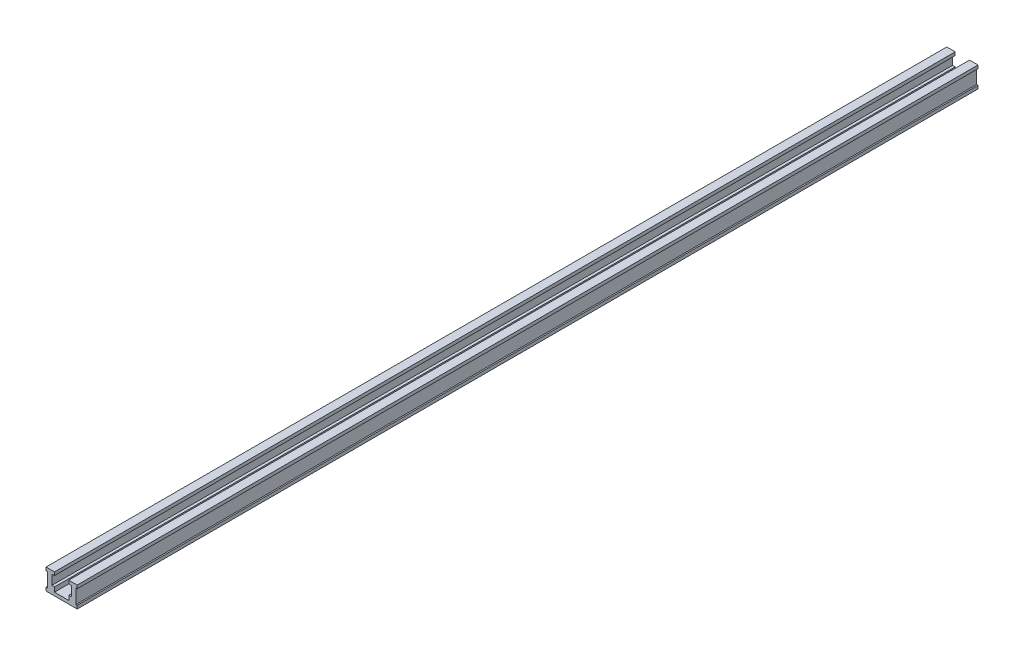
ISO-10303-21;
HEADER;
FILE_DESCRIPTION(('STEP AP214'),'2;1');
FILE_NAME('part.step','',(''),(''),'','','');
FILE_SCHEMA(('AUTOMOTIVE_DESIGN { 1 0 10303 214 1 1 1 1 }'));
ENDSEC;
DATA;
#1=APPLICATION_CONTEXT('core data for automotive mechanical design processes');
#2=APPLICATION_PROTOCOL_DEFINITION('international standard','automotive_design',2000,#1);
#3=PRODUCT_CONTEXT('',#1,'mechanical');
#4=PRODUCT('Part','Part','',(#3));
#5=PRODUCT_RELATED_PRODUCT_CATEGORY('part','',(#4));
#6=PRODUCT_DEFINITION_FORMATION('','',#4);
#7=PRODUCT_DEFINITION_CONTEXT('part definition',#1,'design');
#8=PRODUCT_DEFINITION('design','',#6,#7);
#9=PRODUCT_DEFINITION_SHAPE('','',#8);
#10=(LENGTH_UNIT() NAMED_UNIT(*) SI_UNIT(.MILLI.,.METRE.));
#11=(NAMED_UNIT(*) PLANE_ANGLE_UNIT() SI_UNIT($,.RADIAN.));
#12=(NAMED_UNIT(*) SI_UNIT($,.STERADIAN.) SOLID_ANGLE_UNIT());
#13=UNCERTAINTY_MEASURE_WITH_UNIT(LENGTH_MEASURE(1.E-05),#10,'distance_accuracy_value','');
#14=(GEOMETRIC_REPRESENTATION_CONTEXT(3) GLOBAL_UNCERTAINTY_ASSIGNED_CONTEXT((#13)) GLOBAL_UNIT_ASSIGNED_CONTEXT((#10,
#11,#12)) REPRESENTATION_CONTEXT('',''));
#15=CARTESIAN_POINT('',(0.,0.,0.));
#16=DIRECTION('',(0.,0.,1.));
#17=DIRECTION('',(1.,0.,0.));
#18=AXIS2_PLACEMENT_3D('',#15,#16,#17);
#19=CARTESIAN_POINT('',(2.90949351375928,-9.45107636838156,550.));
#20=DIRECTION('',(0.,-1.,0.));
#21=DIRECTION('',(0.,0.,-1.));
#22=AXIS2_PLACEMENT_3D('',#19,#20,#21);
#23=PLANE('',#22);
#24=DIRECTION('',(-1.,0.,0.));
#25=VECTOR('',#24,1.);
#26=CARTESIAN_POINT('',(2.90949351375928,-9.45107636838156,0.));
#27=LINE('',#26,#25);
#28=CARTESIAN_POINT('',(3.70324351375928,-9.45107636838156,0.));
#29=VERTEX_POINT('',#28);
#30=CARTESIAN_POINT('',(2.90949351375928,-9.45107636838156,0.));
#31=VERTEX_POINT('',#30);
#32=EDGE_CURVE('E224',#29,#31,#27,.T.);
#33=ORIENTED_EDGE('',*,*,#32,.T.);
#34=DIRECTION('',(0.,0.,-1.));
#35=VECTOR('',#34,1.);
#36=CARTESIAN_POINT('',(2.90949351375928,-9.45107636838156,550.));
#37=LINE('',#36,#35);
#38=CARTESIAN_POINT('',(2.90949351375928,-9.45107636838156,550.));
#39=VERTEX_POINT('',#38);
#40=EDGE_CURVE('E11',#39,#31,#37,.T.);
#41=ORIENTED_EDGE('',*,*,#40,.F.);
#42=DIRECTION('',(-1.,0.,0.));
#43=VECTOR('',#42,1.);
#44=CARTESIAN_POINT('',(2.90949351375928,-9.45107636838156,550.));
#45=LINE('',#44,#43);
#46=CARTESIAN_POINT('',(3.70324351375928,-9.45107636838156,550.));
#47=VERTEX_POINT('',#46);
#48=EDGE_CURVE('E270',#47,#39,#45,.T.);
#49=ORIENTED_EDGE('',*,*,#48,.F.);
#50=DIRECTION('',(0.,0.,-1.));
#51=VECTOR('',#50,1.);
#52=CARTESIAN_POINT('',(3.70324351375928,-9.45107636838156,550.));
#53=LINE('',#52,#51);
#54=EDGE_CURVE('E220',#47,#29,#53,.T.);
#55=ORIENTED_EDGE('',*,*,#54,.T.);
#56=EDGE_LOOP('',(#33,#41,#49,#55));
#57=FACE_BOUND('',#56,.T.);
#58=ADVANCED_FACE('F32',(#57),#23,.F.);
#59=CARTESIAN_POINT('',(2.90949351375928,-0.719826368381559,550.));
#60=DIRECTION('',(-1.,0.,0.));
#61=DIRECTION('',(0.,0.,1.));
#62=AXIS2_PLACEMENT_3D('',#59,#60,#61);
#63=PLANE('',#62);
#64=DIRECTION('',(0.,1.,0.));
#65=VECTOR('',#64,1.);
#66=CARTESIAN_POINT('',(2.90949351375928,-0.719826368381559,0.));
#67=LINE('',#66,#65);
#68=CARTESIAN_POINT('',(2.90949351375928,-0.719826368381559,0.));
#69=VERTEX_POINT('',#68);
#70=EDGE_CURVE('E227',#31,#69,#67,.T.);
#71=ORIENTED_EDGE('',*,*,#70,.T.);
#72=DIRECTION('',(0.,0.,-1.));
#73=VECTOR('',#72,1.);
#74=CARTESIAN_POINT('',(2.90949351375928,-0.719826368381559,550.));
#75=LINE('',#74,#73);
#76=CARTESIAN_POINT('',(2.90949351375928,-0.719826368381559,550.));
#77=VERTEX_POINT('',#76);
#78=EDGE_CURVE('E40',#77,#69,#75,.T.);
#79=ORIENTED_EDGE('',*,*,#78,.F.);
#80=DIRECTION('',(0.,1.,0.));
#81=VECTOR('',#80,1.);
#82=CARTESIAN_POINT('',(2.90949351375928,-0.719826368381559,550.));
#83=LINE('',#82,#81);
#84=EDGE_CURVE('E139',#39,#77,#83,.T.);
#85=ORIENTED_EDGE('',*,*,#84,.F.);
#86=ORIENTED_EDGE('',*,*,#40,.T.);
#87=EDGE_LOOP('',(#71,#79,#85,#86));
#88=FACE_BOUND('',#87,.T.);
#89=ADVANCED_FACE('F408',(#88),#63,.F.);
#90=CARTESIAN_POINT('',(3.70324351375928,-0.719826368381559,550.));
#91=DIRECTION('',(0.,1.,0.));
#92=DIRECTION('',(0.,0.,1.));
#93=AXIS2_PLACEMENT_3D('',#90,#91,#92);
#94=PLANE('',#93);
#95=DIRECTION('',(1.,0.,0.));
#96=VECTOR('',#95,1.);
#97=CARTESIAN_POINT('',(3.70324351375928,-0.719826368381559,0.));
#98=LINE('',#97,#96);
#99=CARTESIAN_POINT('',(3.70324351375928,-0.719826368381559,0.));
#100=VERTEX_POINT('',#99);
#101=EDGE_CURVE('E229',#69,#100,#98,.T.);
#102=ORIENTED_EDGE('',*,*,#101,.T.);
#103=DIRECTION('',(0.,0.,-1.));
#104=VECTOR('',#103,1.);
#105=CARTESIAN_POINT('',(3.70324351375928,-0.719826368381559,550.));
#106=LINE('',#105,#104);
#107=CARTESIAN_POINT('',(3.70324351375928,-0.719826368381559,550.));
#108=VERTEX_POINT('',#107);
#109=EDGE_CURVE('E325',#108,#100,#106,.T.);
#110=ORIENTED_EDGE('',*,*,#109,.F.);
#111=DIRECTION('',(1.,0.,0.));
#112=VECTOR('',#111,1.);
#113=CARTESIAN_POINT('',(3.70324351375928,-0.719826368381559,550.));
#114=LINE('',#113,#112);
#115=EDGE_CURVE('E333',#77,#108,#114,.T.);
#116=ORIENTED_EDGE('',*,*,#115,.F.);
#117=ORIENTED_EDGE('',*,*,#78,.T.);
#118=EDGE_LOOP('',(#102,#110,#116,#117));
#119=FACE_BOUND('',#118,.T.);
#120=ADVANCED_FACE('F331',(#119),#94,.F.);
#121=CARTESIAN_POINT('',(3.70324351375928,1.26454863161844,550.));
#122=DIRECTION('',(-1.,0.,0.));
#123=DIRECTION('',(0.,0.,1.));
#124=AXIS2_PLACEMENT_3D('',#121,#122,#123);
#125=PLANE('',#124);
#126=DIRECTION('',(0.,1.,0.));
#127=VECTOR('',#126,1.);
#128=CARTESIAN_POINT('',(3.70324351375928,1.26454863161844,0.));
#129=LINE('',#128,#127);
#130=CARTESIAN_POINT('',(3.70324351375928,1.26454863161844,0.));
#131=VERTEX_POINT('',#130);
#132=EDGE_CURVE('E231',#100,#131,#129,.T.);
#133=ORIENTED_EDGE('',*,*,#132,.T.);
#134=DIRECTION('',(0.,0.,-1.));
#135=VECTOR('',#134,1.);
#136=CARTESIAN_POINT('',(3.70324351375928,1.26454863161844,550.));
#137=LINE('',#136,#135);
#138=CARTESIAN_POINT('',(3.70324351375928,1.26454863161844,550.));
#139=VERTEX_POINT('',#138);
#140=EDGE_CURVE('E322',#139,#131,#137,.T.);
#141=ORIENTED_EDGE('',*,*,#140,.F.);
#142=DIRECTION('',(0.,1.,0.));
#143=VECTOR('',#142,1.);
#144=CARTESIAN_POINT('',(3.70324351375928,1.26454863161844,550.));
#145=LINE('',#144,#143);
#146=EDGE_CURVE('E351',#108,#139,#145,.T.);
#147=ORIENTED_EDGE('',*,*,#146,.F.);
#148=ORIENTED_EDGE('',*,*,#109,.T.);
#149=EDGE_LOOP('',(#133,#141,#147,#148));
#150=FACE_BOUND('',#149,.T.);
#151=ADVANCED_FACE('F342',(#150),#125,.F.);
#152=CARTESIAN_POINT('',(-1.45613148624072,1.26454863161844,550.));
#153=DIRECTION('',(0.,-1.,0.));
#154=DIRECTION('',(0.,0.,-1.));
#155=AXIS2_PLACEMENT_3D('',#152,#153,#154);
#156=PLANE('',#155);
#157=DIRECTION('',(-1.,0.,0.));
#158=VECTOR('',#157,1.);
#159=CARTESIAN_POINT('',(-1.45613148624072,1.26454863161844,0.));
#160=LINE('',#159,#158);
#161=CARTESIAN_POINT('',(-1.45613148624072,1.26454863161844,0.));
#162=VERTEX_POINT('',#161);
#163=EDGE_CURVE('E233',#131,#162,#160,.T.);
#164=ORIENTED_EDGE('',*,*,#163,.T.);
#165=DIRECTION('',(0.,0.,-1.));
#166=VECTOR('',#165,1.);
#167=CARTESIAN_POINT('',(-1.45613148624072,1.26454863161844,550.));
#168=LINE('',#167,#166);
#169=CARTESIAN_POINT('',(-1.45613148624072,1.26454863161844,550.));
#170=VERTEX_POINT('',#169);
#171=EDGE_CURVE('E319',#170,#162,#168,.T.);
#172=ORIENTED_EDGE('',*,*,#171,.F.);
#173=DIRECTION('',(-1.,0.,0.));
#174=VECTOR('',#173,1.);
#175=CARTESIAN_POINT('',(-1.45613148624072,1.26454863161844,550.));
#176=LINE('',#175,#174);
#177=EDGE_CURVE('E348',#139,#170,#176,.T.);
#178=ORIENTED_EDGE('',*,*,#177,.F.);
#179=ORIENTED_EDGE('',*,*,#140,.T.);
#180=EDGE_LOOP('',(#164,#172,#178,#179));
#181=FACE_BOUND('',#180,.T.);
#182=ADVANCED_FACE('F346',(#181),#156,.F.);
#183=CARTESIAN_POINT('',(-1.45613148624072,-0.719826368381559,550.));
#184=DIRECTION('',(1.,0.,0.));
#185=DIRECTION('',(0.,0.,-1.));
#186=AXIS2_PLACEMENT_3D('',#183,#184,#185);
#187=PLANE('',#186);
#188=DIRECTION('',(0.,-1.,0.));
#189=VECTOR('',#188,1.);
#190=CARTESIAN_POINT('',(-1.45613148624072,-0.719826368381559,0.));
#191=LINE('',#190,#189);
#192=CARTESIAN_POINT('',(-1.45613148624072,-0.719826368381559,0.));
#193=VERTEX_POINT('',#192);
#194=EDGE_CURVE('E235',#162,#193,#191,.T.);
#195=ORIENTED_EDGE('',*,*,#194,.T.);
#196=DIRECTION('',(0.,0.,-1.));
#197=VECTOR('',#196,1.);
#198=CARTESIAN_POINT('',(-1.45613148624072,-0.719826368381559,550.));
#199=LINE('',#198,#197);
#200=CARTESIAN_POINT('',(-1.45613148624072,-0.719826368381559,550.));
#201=VERTEX_POINT('',#200);
#202=EDGE_CURVE('E316',#201,#193,#199,.T.);
#203=ORIENTED_EDGE('',*,*,#202,.F.);
#204=DIRECTION('',(0.,-1.,0.));
#205=VECTOR('',#204,1.);
#206=CARTESIAN_POINT('',(-1.45613148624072,-0.719826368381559,550.));
#207=LINE('',#206,#205);
#208=EDGE_CURVE('E350',#170,#201,#207,.T.);
#209=ORIENTED_EDGE('',*,*,#208,.F.);
#210=ORIENTED_EDGE('',*,*,#171,.T.);
#211=EDGE_LOOP('',(#195,#203,#209,#210));
#212=FACE_BOUND('',#211,.T.);
#213=ADVANCED_FACE('F421',(#212),#187,.F.);
#214=CARTESIAN_POINT('',(0.131368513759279,-0.719826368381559,550.));
#215=DIRECTION('',(0.,1.,0.));
#216=DIRECTION('',(0.,0.,1.));
#217=AXIS2_PLACEMENT_3D('',#214,#215,#216);
#218=PLANE('',#217);
#219=DIRECTION('',(1.,0.,0.));
#220=VECTOR('',#219,1.);
#221=CARTESIAN_POINT('',(0.131368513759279,-0.719826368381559,0.));
#222=LINE('',#221,#220);
#223=CARTESIAN_POINT('',(0.131368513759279,-0.719826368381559,0.));
#224=VERTEX_POINT('',#223);
#225=EDGE_CURVE('E237',#193,#224,#222,.T.);
#226=ORIENTED_EDGE('',*,*,#225,.T.);
#227=DIRECTION('',(0.,0.,-1.));
#228=VECTOR('',#227,1.);
#229=CARTESIAN_POINT('',(0.131368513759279,-0.719826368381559,550.));
#230=LINE('',#229,#228);
#231=CARTESIAN_POINT('',(0.131368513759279,-0.719826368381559,550.));
#232=VERTEX_POINT('',#231);
#233=EDGE_CURVE('E313',#232,#224,#230,.T.);
#234=ORIENTED_EDGE('',*,*,#233,.F.);
#235=DIRECTION('',(1.,0.,0.));
#236=VECTOR('',#235,1.);
#237=CARTESIAN_POINT('',(0.131368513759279,-0.719826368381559,550.));
#238=LINE('',#237,#236);
#239=EDGE_CURVE('E353',#201,#232,#238,.T.);
#240=ORIENTED_EDGE('',*,*,#239,.F.);
#241=ORIENTED_EDGE('',*,*,#202,.T.);
#242=EDGE_LOOP('',(#226,#234,#240,#241));
#243=FACE_BOUND('',#242,.T.);
#244=ADVANCED_FACE('F424',(#243),#218,.F.);
#245=CARTESIAN_POINT('',(0.131368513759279,-6.67295136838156,550.));
#246=DIRECTION('',(1.,0.,0.));
#247=DIRECTION('',(0.,0.,-1.));
#248=AXIS2_PLACEMENT_3D('',#245,#246,#247);
#249=PLANE('',#248);
#250=DIRECTION('',(0.,-1.,0.));
#251=VECTOR('',#250,1.);
#252=CARTESIAN_POINT('',(0.131368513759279,-6.67295136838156,0.));
#253=LINE('',#252,#251);
#254=CARTESIAN_POINT('',(0.131368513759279,-6.67295136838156,0.));
#255=VERTEX_POINT('',#254);
#256=EDGE_CURVE('E239',#224,#255,#253,.T.);
#257=ORIENTED_EDGE('',*,*,#256,.T.);
#258=DIRECTION('',(0.,0.,-1.));
#259=VECTOR('',#258,1.);
#260=CARTESIAN_POINT('',(0.131368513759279,-6.67295136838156,550.));
#261=LINE('',#260,#259);
#262=CARTESIAN_POINT('',(0.131368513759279,-6.67295136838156,550.));
#263=VERTEX_POINT('',#262);
#264=EDGE_CURVE('E310',#263,#255,#261,.T.);
#265=ORIENTED_EDGE('',*,*,#264,.F.);
#266=DIRECTION('',(0.,-1.,0.));
#267=VECTOR('',#266,1.);
#268=CARTESIAN_POINT('',(0.131368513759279,-6.67295136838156,550.));
#269=LINE('',#268,#267);
#270=EDGE_CURVE('E359',#232,#263,#269,.T.);
#271=ORIENTED_EDGE('',*,*,#270,.F.);
#272=ORIENTED_EDGE('',*,*,#233,.T.);
#273=EDGE_LOOP('',(#257,#265,#271,#272));
#274=FACE_BOUND('',#273,.T.);
#275=ADVANCED_FACE('F428',(#274),#249,.F.);
#276=CARTESIAN_POINT('',(-1.45613148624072,-6.67295136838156,550.));
#277=DIRECTION('',(0.,-1.,0.));
#278=DIRECTION('',(0.,0.,-1.));
#279=AXIS2_PLACEMENT_3D('',#276,#277,#278);
#280=PLANE('',#279);
#281=DIRECTION('',(-1.,0.,0.));
#282=VECTOR('',#281,1.);
#283=CARTESIAN_POINT('',(-1.45613148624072,-6.67295136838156,0.));
#284=LINE('',#283,#282);
#285=CARTESIAN_POINT('',(-1.45613148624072,-6.67295136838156,0.));
#286=VERTEX_POINT('',#285);
#287=EDGE_CURVE('E241',#255,#286,#284,.T.);
#288=ORIENTED_EDGE('',*,*,#287,.T.);
#289=DIRECTION('',(0.,0.,-1.));
#290=VECTOR('',#289,1.);
#291=CARTESIAN_POINT('',(-1.45613148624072,-6.67295136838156,550.));
#292=LINE('',#291,#290);
#293=CARTESIAN_POINT('',(-1.45613148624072,-6.67295136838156,550.));
#294=VERTEX_POINT('',#293);
#295=EDGE_CURVE('E307',#294,#286,#292,.T.);
#296=ORIENTED_EDGE('',*,*,#295,.F.);
#297=DIRECTION('',(-1.,0.,0.));
#298=VECTOR('',#297,1.);
#299=CARTESIAN_POINT('',(-1.45613148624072,-6.67295136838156,550.));
#300=LINE('',#299,#298);
#301=EDGE_CURVE('E361',#263,#294,#300,.T.);
#302=ORIENTED_EDGE('',*,*,#301,.F.);
#303=ORIENTED_EDGE('',*,*,#264,.T.);
#304=EDGE_LOOP('',(#288,#296,#302,#303));
#305=FACE_BOUND('',#304,.T.);
#306=ADVANCED_FACE('F432',(#305),#280,.F.);
#307=CARTESIAN_POINT('',(-1.45613148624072,-9.45107636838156,550.));
#308=DIRECTION('',(1.,0.,0.));
#309=DIRECTION('',(0.,0.,-1.));
#310=AXIS2_PLACEMENT_3D('',#307,#308,#309);
#311=PLANE('',#310);
#312=DIRECTION('',(0.,-1.,0.));
#313=VECTOR('',#312,1.);
#314=CARTESIAN_POINT('',(-1.45613148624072,-9.45107636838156,0.));
#315=LINE('',#314,#313);
#316=CARTESIAN_POINT('',(-1.45613148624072,-9.45107636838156,0.));
#317=VERTEX_POINT('',#316);
#318=EDGE_CURVE('E243',#286,#317,#315,.T.);
#319=ORIENTED_EDGE('',*,*,#318,.T.);
#320=DIRECTION('',(0.,0.,-1.));
#321=VECTOR('',#320,1.);
#322=CARTESIAN_POINT('',(-1.45613148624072,-9.45107636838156,550.));
#323=LINE('',#322,#321);
#324=CARTESIAN_POINT('',(-1.45613148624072,-9.45107636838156,550.));
#325=VERTEX_POINT('',#324);
#326=EDGE_CURVE('E304',#325,#317,#323,.T.);
#327=ORIENTED_EDGE('',*,*,#326,.F.);
#328=DIRECTION('',(0.,-1.,0.));
#329=VECTOR('',#328,1.);
#330=CARTESIAN_POINT('',(-1.45613148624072,-9.45107636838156,550.));
#331=LINE('',#330,#329);
#332=EDGE_CURVE('E363',#294,#325,#331,.T.);
#333=ORIENTED_EDGE('',*,*,#332,.F.);
#334=ORIENTED_EDGE('',*,*,#295,.T.);
#335=EDGE_LOOP('',(#319,#327,#333,#334));
#336=FACE_BOUND('',#335,.T.);
#337=ADVANCED_FACE('F436',(#336),#311,.F.);
#338=CARTESIAN_POINT('',(-1.45613148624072,-9.45107636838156,550.));
#339=DIRECTION('',(0.,-1.,0.));
#340=DIRECTION('',(0.,0.,-1.));
#341=AXIS2_PLACEMENT_3D('',#338,#339,#340);
#342=PLANE('',#341);
#343=DIRECTION('',(-1.,0.,0.));
#344=VECTOR('',#343,1.);
#345=CARTESIAN_POINT('',(-1.45613148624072,-9.45107636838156,0.));
#346=LINE('',#345,#344);
#347=CARTESIAN_POINT('',(-10.1873814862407,-9.45107636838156,0.));
#348=VERTEX_POINT('',#347);
#349=EDGE_CURVE('E245',#317,#348,#346,.T.);
#350=ORIENTED_EDGE('',*,*,#349,.T.);
#351=DIRECTION('',(0.,0.,-1.));
#352=VECTOR('',#351,1.);
#353=CARTESIAN_POINT('',(-10.1873814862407,-9.45107636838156,550.));
#354=LINE('',#353,#352);
#355=CARTESIAN_POINT('',(-10.1873814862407,-9.45107636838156,550.));
#356=VERTEX_POINT('',#355);
#357=EDGE_CURVE('E301',#356,#348,#354,.T.);
#358=ORIENTED_EDGE('',*,*,#357,.F.);
#359=DIRECTION('',(-1.,0.,0.));
#360=VECTOR('',#359,1.);
#361=CARTESIAN_POINT('',(-1.45613148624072,-9.45107636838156,550.));
#362=LINE('',#361,#360);
#363=EDGE_CURVE('E365',#325,#356,#362,.T.);
#364=ORIENTED_EDGE('',*,*,#363,.F.);
#365=ORIENTED_EDGE('',*,*,#326,.T.);
#366=EDGE_LOOP('',(#350,#358,#364,#365));
#367=FACE_BOUND('',#366,.T.);
#368=ADVANCED_FACE('F440',(#367),#342,.F.);
#369=CARTESIAN_POINT('',(-10.1873814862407,-6.67295136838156,550.));
#370=DIRECTION('',(-1.,0.,0.));
#371=DIRECTION('',(0.,0.,1.));
#372=AXIS2_PLACEMENT_3D('',#369,#370,#371);
#373=PLANE('',#372);
#374=DIRECTION('',(0.,1.,0.));
#375=VECTOR('',#374,1.);
#376=CARTESIAN_POINT('',(-10.1873814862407,-6.67295136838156,0.));
#377=LINE('',#376,#375);
#378=CARTESIAN_POINT('',(-10.1873814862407,-6.67295136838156,0.));
#379=VERTEX_POINT('',#378);
#380=EDGE_CURVE('E247',#348,#379,#377,.T.);
#381=ORIENTED_EDGE('',*,*,#380,.T.);
#382=DIRECTION('',(0.,0.,-1.));
#383=VECTOR('',#382,1.);
#384=CARTESIAN_POINT('',(-10.1873814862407,-6.67295136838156,550.));
#385=LINE('',#384,#383);
#386=CARTESIAN_POINT('',(-10.1873814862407,-6.67295136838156,550.));
#387=VERTEX_POINT('',#386);
#388=EDGE_CURVE('E298',#387,#379,#385,.T.);
#389=ORIENTED_EDGE('',*,*,#388,.F.);
#390=DIRECTION('',(0.,1.,0.));
#391=VECTOR('',#390,1.);
#392=CARTESIAN_POINT('',(-10.1873814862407,-6.67295136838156,550.));
#393=LINE('',#392,#391);
#394=EDGE_CURVE('E367',#356,#387,#393,.T.);
#395=ORIENTED_EDGE('',*,*,#394,.F.);
#396=ORIENTED_EDGE('',*,*,#357,.T.);
#397=EDGE_LOOP('',(#381,#389,#395,#396));
#398=FACE_BOUND('',#397,.T.);
#399=ADVANCED_FACE('F444',(#398),#373,.F.);
#400=CARTESIAN_POINT('',(-11.7748814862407,-6.67295136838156,550.));
#401=DIRECTION('',(0.,-1.,0.));
#402=DIRECTION('',(0.,0.,-1.));
#403=AXIS2_PLACEMENT_3D('',#400,#401,#402);
#404=PLANE('',#403);
#405=DIRECTION('',(-1.,0.,0.));
#406=VECTOR('',#405,1.);
#407=CARTESIAN_POINT('',(-11.7748814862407,-6.67295136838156,0.));
#408=LINE('',#407,#406);
#409=CARTESIAN_POINT('',(-11.7748814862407,-6.67295136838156,0.));
#410=VERTEX_POINT('',#409);
#411=EDGE_CURVE('E249',#379,#410,#408,.T.);
#412=ORIENTED_EDGE('',*,*,#411,.T.);
#413=DIRECTION('',(0.,0.,-1.));
#414=VECTOR('',#413,1.);
#415=CARTESIAN_POINT('',(-11.7748814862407,-6.67295136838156,550.));
#416=LINE('',#415,#414);
#417=CARTESIAN_POINT('',(-11.7748814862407,-6.67295136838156,550.));
#418=VERTEX_POINT('',#417);
#419=EDGE_CURVE('E295',#418,#410,#416,.T.);
#420=ORIENTED_EDGE('',*,*,#419,.F.);
#421=DIRECTION('',(-1.,0.,0.));
#422=VECTOR('',#421,1.);
#423=CARTESIAN_POINT('',(-11.7748814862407,-6.67295136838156,550.));
#424=LINE('',#423,#422);
#425=EDGE_CURVE('E369',#387,#418,#424,.T.);
#426=ORIENTED_EDGE('',*,*,#425,.F.);
#427=ORIENTED_EDGE('',*,*,#388,.T.);
#428=EDGE_LOOP('',(#412,#420,#426,#427));
#429=FACE_BOUND('',#428,.T.);
#430=ADVANCED_FACE('F448',(#429),#404,.F.);
#431=CARTESIAN_POINT('',(-11.7748814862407,-0.719826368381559,550.));
#432=DIRECTION('',(-1.,0.,0.));
#433=DIRECTION('',(0.,0.,1.));
#434=AXIS2_PLACEMENT_3D('',#431,#432,#433);
#435=PLANE('',#434);
#436=DIRECTION('',(0.,1.,0.));
#437=VECTOR('',#436,1.);
#438=CARTESIAN_POINT('',(-11.7748814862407,-0.719826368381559,0.));
#439=LINE('',#438,#437);
#440=CARTESIAN_POINT('',(-11.7748814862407,-0.719826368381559,0.));
#441=VERTEX_POINT('',#440);
#442=EDGE_CURVE('E251',#410,#441,#439,.T.);
#443=ORIENTED_EDGE('',*,*,#442,.T.);
#444=DIRECTION('',(0.,0.,-1.));
#445=VECTOR('',#444,1.);
#446=CARTESIAN_POINT('',(-11.7748814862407,-0.719826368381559,550.));
#447=LINE('',#446,#445);
#448=CARTESIAN_POINT('',(-11.7748814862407,-0.719826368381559,550.));
#449=VERTEX_POINT('',#448);
#450=EDGE_CURVE('E292',#449,#441,#447,.T.);
#451=ORIENTED_EDGE('',*,*,#450,.F.);
#452=DIRECTION('',(0.,1.,0.));
#453=VECTOR('',#452,1.);
#454=CARTESIAN_POINT('',(-11.7748814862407,-0.719826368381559,550.));
#455=LINE('',#454,#453);
#456=EDGE_CURVE('E371',#418,#449,#455,.T.);
#457=ORIENTED_EDGE('',*,*,#456,.F.);
#458=ORIENTED_EDGE('',*,*,#419,.T.);
#459=EDGE_LOOP('',(#443,#451,#457,#458));
#460=FACE_BOUND('',#459,.T.);
#461=ADVANCED_FACE('F452',(#460),#435,.F.);
#462=CARTESIAN_POINT('',(-10.1873814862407,-0.719826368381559,550.));
#463=DIRECTION('',(0.,1.,0.));
#464=DIRECTION('',(0.,0.,1.));
#465=AXIS2_PLACEMENT_3D('',#462,#463,#464);
#466=PLANE('',#465);
#467=DIRECTION('',(1.,0.,0.));
#468=VECTOR('',#467,1.);
#469=CARTESIAN_POINT('',(-10.1873814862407,-0.719826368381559,0.));
#470=LINE('',#469,#468);
#471=CARTESIAN_POINT('',(-10.1873814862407,-0.719826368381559,0.));
#472=VERTEX_POINT('',#471);
#473=EDGE_CURVE('E253',#441,#472,#470,.T.);
#474=ORIENTED_EDGE('',*,*,#473,.T.);
#475=DIRECTION('',(0.,0.,-1.));
#476=VECTOR('',#475,1.);
#477=CARTESIAN_POINT('',(-10.1873814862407,-0.719826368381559,550.));
#478=LINE('',#477,#476);
#479=CARTESIAN_POINT('',(-10.1873814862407,-0.719826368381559,550.));
#480=VERTEX_POINT('',#479);
#481=EDGE_CURVE('E289',#480,#472,#478,.T.);
#482=ORIENTED_EDGE('',*,*,#481,.F.);
#483=DIRECTION('',(1.,0.,0.));
#484=VECTOR('',#483,1.);
#485=CARTESIAN_POINT('',(-10.1873814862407,-0.719826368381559,550.));
#486=LINE('',#485,#484);
#487=EDGE_CURVE('E373',#449,#480,#486,.T.);
#488=ORIENTED_EDGE('',*,*,#487,.F.);
#489=ORIENTED_EDGE('',*,*,#450,.T.);
#490=EDGE_LOOP('',(#474,#482,#488,#489));
#491=FACE_BOUND('',#490,.T.);
#492=ADVANCED_FACE('F456',(#491),#466,.F.);
#493=CARTESIAN_POINT('',(-10.1873814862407,1.26454863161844,550.));
#494=DIRECTION('',(-1.,0.,0.));
#495=DIRECTION('',(0.,0.,1.));
#496=AXIS2_PLACEMENT_3D('',#493,#494,#495);
#497=PLANE('',#496);
#498=DIRECTION('',(0.,1.,0.));
#499=VECTOR('',#498,1.);
#500=CARTESIAN_POINT('',(-10.1873814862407,1.26454863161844,0.));
#501=LINE('',#500,#499);
#502=CARTESIAN_POINT('',(-10.1873814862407,1.26454863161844,0.));
#503=VERTEX_POINT('',#502);
#504=EDGE_CURVE('E255',#472,#503,#501,.T.);
#505=ORIENTED_EDGE('',*,*,#504,.T.);
#506=DIRECTION('',(0.,0.,-1.));
#507=VECTOR('',#506,1.);
#508=CARTESIAN_POINT('',(-10.1873814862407,1.26454863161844,550.));
#509=LINE('',#508,#507);
#510=CARTESIAN_POINT('',(-10.1873814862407,1.26454863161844,550.));
#511=VERTEX_POINT('',#510);
#512=EDGE_CURVE('E286',#511,#503,#509,.T.);
#513=ORIENTED_EDGE('',*,*,#512,.F.);
#514=DIRECTION('',(0.,1.,0.));
#515=VECTOR('',#514,1.);
#516=CARTESIAN_POINT('',(-10.1873814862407,1.26454863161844,550.));
#517=LINE('',#516,#515);
#518=EDGE_CURVE('E375',#480,#511,#517,.T.);
#519=ORIENTED_EDGE('',*,*,#518,.F.);
#520=ORIENTED_EDGE('',*,*,#481,.T.);
#521=EDGE_LOOP('',(#505,#513,#519,#520));
#522=FACE_BOUND('',#521,.T.);
#523=ADVANCED_FACE('F460',(#522),#497,.F.);
#524=CARTESIAN_POINT('',(-15.3467564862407,1.26454863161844,550.));
#525=DIRECTION('',(0.,-1.,0.));
#526=DIRECTION('',(0.,0.,-1.));
#527=AXIS2_PLACEMENT_3D('',#524,#525,#526);
#528=PLANE('',#527);
#529=DIRECTION('',(-1.,0.,0.));
#530=VECTOR('',#529,1.);
#531=CARTESIAN_POINT('',(-15.3467564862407,1.26454863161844,0.));
#532=LINE('',#531,#530);
#533=CARTESIAN_POINT('',(-15.3467564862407,1.26454863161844,0.));
#534=VERTEX_POINT('',#533);
#535=EDGE_CURVE('E257',#503,#534,#532,.T.);
#536=ORIENTED_EDGE('',*,*,#535,.T.);
#537=DIRECTION('',(0.,0.,-1.));
#538=VECTOR('',#537,1.);
#539=CARTESIAN_POINT('',(-15.3467564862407,1.26454863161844,550.));
#540=LINE('',#539,#538);
#541=CARTESIAN_POINT('',(-15.3467564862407,1.26454863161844,550.));
#542=VERTEX_POINT('',#541);
#543=EDGE_CURVE('E283',#542,#534,#540,.T.);
#544=ORIENTED_EDGE('',*,*,#543,.F.);
#545=DIRECTION('',(-1.,0.,0.));
#546=VECTOR('',#545,1.);
#547=CARTESIAN_POINT('',(-15.3467564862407,1.26454863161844,550.));
#548=LINE('',#547,#546);
#549=EDGE_CURVE('E377',#511,#542,#548,.T.);
#550=ORIENTED_EDGE('',*,*,#549,.F.);
#551=ORIENTED_EDGE('',*,*,#512,.T.);
#552=EDGE_LOOP('',(#536,#544,#550,#551));
#553=FACE_BOUND('',#552,.T.);
#554=ADVANCED_FACE('F464',(#553),#528,.F.);
#555=CARTESIAN_POINT('',(-15.3467564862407,-0.719826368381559,550.));
#556=DIRECTION('',(1.,0.,0.));
#557=DIRECTION('',(0.,0.,-1.));
#558=AXIS2_PLACEMENT_3D('',#555,#556,#557);
#559=PLANE('',#558);
#560=DIRECTION('',(0.,-1.,0.));
#561=VECTOR('',#560,1.);
#562=CARTESIAN_POINT('',(-15.3467564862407,-0.719826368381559,0.));
#563=LINE('',#562,#561);
#564=CARTESIAN_POINT('',(-15.3467564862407,-0.719826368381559,0.));
#565=VERTEX_POINT('',#564);
#566=EDGE_CURVE('E259',#534,#565,#563,.T.);
#567=ORIENTED_EDGE('',*,*,#566,.T.);
#568=DIRECTION('',(0.,0.,-1.));
#569=VECTOR('',#568,1.);
#570=CARTESIAN_POINT('',(-15.3467564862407,-0.719826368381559,550.));
#571=LINE('',#570,#569);
#572=CARTESIAN_POINT('',(-15.3467564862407,-0.719826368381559,550.));
#573=VERTEX_POINT('',#572);
#574=EDGE_CURVE('E280',#573,#565,#571,.T.);
#575=ORIENTED_EDGE('',*,*,#574,.F.);
#576=DIRECTION('',(0.,-1.,0.));
#577=VECTOR('',#576,1.);
#578=CARTESIAN_POINT('',(-15.3467564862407,-0.719826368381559,550.));
#579=LINE('',#578,#577);
#580=EDGE_CURVE('E379',#542,#573,#579,.T.);
#581=ORIENTED_EDGE('',*,*,#580,.F.);
#582=ORIENTED_EDGE('',*,*,#543,.T.);
#583=EDGE_LOOP('',(#567,#575,#581,#582));
#584=FACE_BOUND('',#583,.T.);
#585=ADVANCED_FACE('F468',(#584),#559,.F.);
#586=CARTESIAN_POINT('',(-14.5530064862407,-0.719826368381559,550.));
#587=DIRECTION('',(0.,1.,0.));
#588=DIRECTION('',(0.,0.,1.));
#589=AXIS2_PLACEMENT_3D('',#586,#587,#588);
#590=PLANE('',#589);
#591=DIRECTION('',(1.,0.,0.));
#592=VECTOR('',#591,1.);
#593=CARTESIAN_POINT('',(-14.5530064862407,-0.719826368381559,0.));
#594=LINE('',#593,#592);
#595=CARTESIAN_POINT('',(-14.5530064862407,-0.719826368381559,0.));
#596=VERTEX_POINT('',#595);
#597=EDGE_CURVE('E261',#565,#596,#594,.T.);
#598=ORIENTED_EDGE('',*,*,#597,.T.);
#599=DIRECTION('',(0.,0.,-1.));
#600=VECTOR('',#599,1.);
#601=CARTESIAN_POINT('',(-14.5530064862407,-0.719826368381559,550.));
#602=LINE('',#601,#600);
#603=CARTESIAN_POINT('',(-14.5530064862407,-0.719826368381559,550.));
#604=VERTEX_POINT('',#603);
#605=EDGE_CURVE('E277',#604,#596,#602,.T.);
#606=ORIENTED_EDGE('',*,*,#605,.F.);
#607=DIRECTION('',(1.,0.,0.));
#608=VECTOR('',#607,1.);
#609=CARTESIAN_POINT('',(-14.5530064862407,-0.719826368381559,550.));
#610=LINE('',#609,#608);
#611=EDGE_CURVE('E381',#573,#604,#610,.T.);
#612=ORIENTED_EDGE('',*,*,#611,.F.);
#613=ORIENTED_EDGE('',*,*,#574,.T.);
#614=EDGE_LOOP('',(#598,#606,#612,#613));
#615=FACE_BOUND('',#614,.T.);
#616=ADVANCED_FACE('F472',(#615),#590,.F.);
#617=CARTESIAN_POINT('',(-14.5530064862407,-9.45107636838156,550.));
#618=DIRECTION('',(1.,0.,0.));
#619=DIRECTION('',(0.,0.,-1.));
#620=AXIS2_PLACEMENT_3D('',#617,#618,#619);
#621=PLANE('',#620);
#622=DIRECTION('',(0.,-1.,0.));
#623=VECTOR('',#622,1.);
#624=CARTESIAN_POINT('',(-14.5530064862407,-9.45107636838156,0.));
#625=LINE('',#624,#623);
#626=CARTESIAN_POINT('',(-14.5530064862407,-9.45107636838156,0.));
#627=VERTEX_POINT('',#626);
#628=EDGE_CURVE('E263',#596,#627,#625,.T.);
#629=ORIENTED_EDGE('',*,*,#628,.T.);
#630=DIRECTION('',(0.,0.,-1.));
#631=VECTOR('',#630,1.);
#632=CARTESIAN_POINT('',(-14.5530064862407,-9.45107636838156,550.));
#633=LINE('',#632,#631);
#634=CARTESIAN_POINT('',(-14.5530064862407,-9.45107636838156,550.));
#635=VERTEX_POINT('',#634);
#636=EDGE_CURVE('E274',#635,#627,#633,.T.);
#637=ORIENTED_EDGE('',*,*,#636,.F.);
#638=DIRECTION('',(0.,-1.,0.));
#639=VECTOR('',#638,1.);
#640=CARTESIAN_POINT('',(-14.5530064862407,-9.45107636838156,550.));
#641=LINE('',#640,#639);
#642=EDGE_CURVE('E383',#604,#635,#641,.T.);
#643=ORIENTED_EDGE('',*,*,#642,.F.);
#644=ORIENTED_EDGE('',*,*,#605,.T.);
#645=EDGE_LOOP('',(#629,#637,#643,#644));
#646=FACE_BOUND('',#645,.T.);
#647=ADVANCED_FACE('F389',(#646),#621,.F.);
#648=CARTESIAN_POINT('',(-15.3467564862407,-9.45107636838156,550.));
#649=DIRECTION('',(0.,-1.,0.));
#650=DIRECTION('',(0.,0.,-1.));
#651=AXIS2_PLACEMENT_3D('',#648,#649,#650);
#652=PLANE('',#651);
#653=DIRECTION('',(-1.,0.,0.));
#654=VECTOR('',#653,1.);
#655=CARTESIAN_POINT('',(-15.3467564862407,-9.45107636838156,0.));
#656=LINE('',#655,#654);
#657=CARTESIAN_POINT('',(-15.3467564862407,-9.45107636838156,0.));
#658=VERTEX_POINT('',#657);
#659=EDGE_CURVE('E265',#627,#658,#656,.T.);
#660=ORIENTED_EDGE('',*,*,#659,.T.);
#661=DIRECTION('',(0.,0.,-1.));
#662=VECTOR('',#661,1.);
#663=CARTESIAN_POINT('',(-15.3467564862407,-9.45107636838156,550.));
#664=LINE('',#663,#662);
#665=CARTESIAN_POINT('',(-15.3467564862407,-9.45107636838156,550.));
#666=VERTEX_POINT('',#665);
#667=EDGE_CURVE('E215',#666,#658,#664,.T.);
#668=ORIENTED_EDGE('',*,*,#667,.F.);
#669=DIRECTION('',(-1.,0.,0.));
#670=VECTOR('',#669,1.);
#671=CARTESIAN_POINT('',(-15.3467564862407,-9.45107636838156,550.));
#672=LINE('',#671,#670);
#673=EDGE_CURVE('E206',#635,#666,#672,.T.);
#674=ORIENTED_EDGE('',*,*,#673,.F.);
#675=ORIENTED_EDGE('',*,*,#636,.T.);
#676=EDGE_LOOP('',(#660,#668,#674,#675));
#677=FACE_BOUND('',#676,.T.);
#678=ADVANCED_FACE('F393',(#677),#652,.F.);
#679=CARTESIAN_POINT('',(-15.3467564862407,-11.4354513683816,550.));
#680=DIRECTION('',(1.,0.,0.));
#681=DIRECTION('',(0.,0.,-1.));
#682=AXIS2_PLACEMENT_3D('',#679,#680,#681);
#683=PLANE('',#682);
#684=DIRECTION('',(0.,-1.,0.));
#685=VECTOR('',#684,1.);
#686=CARTESIAN_POINT('',(-15.3467564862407,-11.4354513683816,0.));
#687=LINE('',#686,#685);
#688=CARTESIAN_POINT('',(-15.3467564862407,-11.4354513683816,0.));
#689=VERTEX_POINT('',#688);
#690=EDGE_CURVE('E214',#658,#689,#687,.T.);
#691=ORIENTED_EDGE('',*,*,#690,.T.);
#692=DIRECTION('',(0.,0.,-1.));
#693=VECTOR('',#692,1.);
#694=CARTESIAN_POINT('',(-15.3467564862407,-11.4354513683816,550.));
#695=LINE('',#694,#693);
#696=CARTESIAN_POINT('',(-15.3467564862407,-11.4354513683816,550.));
#697=VERTEX_POINT('',#696);
#698=EDGE_CURVE('E211',#697,#689,#695,.T.);
#699=ORIENTED_EDGE('',*,*,#698,.F.);
#700=DIRECTION('',(0.,-1.,0.));
#701=VECTOR('',#700,1.);
#702=CARTESIAN_POINT('',(-15.3467564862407,-11.4354513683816,550.));
#703=LINE('',#702,#701);
#704=EDGE_CURVE('E200',#666,#697,#703,.T.);
#705=ORIENTED_EDGE('',*,*,#704,.F.);
#706=ORIENTED_EDGE('',*,*,#667,.T.);
#707=EDGE_LOOP('',(#691,#699,#705,#706));
#708=FACE_BOUND('',#707,.T.);
#709=ADVANCED_FACE('F212',(#708),#683,.F.);
#710=CARTESIAN_POINT('',(3.70324351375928,-11.4354513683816,550.));
#711=DIRECTION('',(0.,1.,0.));
#712=DIRECTION('',(0.,0.,1.));
#713=AXIS2_PLACEMENT_3D('',#710,#711,#712);
#714=PLANE('',#713);
#715=DIRECTION('',(1.,0.,0.));
#716=VECTOR('',#715,1.);
#717=CARTESIAN_POINT('',(3.70324351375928,-11.4354513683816,0.));
#718=LINE('',#717,#716);
#719=CARTESIAN_POINT('',(3.70324351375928,-11.4354513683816,0.));
#720=VERTEX_POINT('',#719);
#721=EDGE_CURVE('E125',#689,#720,#718,.T.);
#722=ORIENTED_EDGE('',*,*,#721,.T.);
#723=DIRECTION('',(0.,0.,-1.));
#724=VECTOR('',#723,1.);
#725=CARTESIAN_POINT('',(3.70324351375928,-11.4354513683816,550.));
#726=LINE('',#725,#724);
#727=CARTESIAN_POINT('',(3.70324351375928,-11.4354513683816,550.));
#728=VERTEX_POINT('',#727);
#729=EDGE_CURVE('E216',#728,#720,#726,.T.);
#730=ORIENTED_EDGE('',*,*,#729,.F.);
#731=DIRECTION('',(1.,0.,0.));
#732=VECTOR('',#731,1.);
#733=CARTESIAN_POINT('',(3.70324351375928,-11.4354513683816,550.));
#734=LINE('',#733,#732);
#735=EDGE_CURVE('E204',#697,#728,#734,.T.);
#736=ORIENTED_EDGE('',*,*,#735,.F.);
#737=ORIENTED_EDGE('',*,*,#698,.T.);
#738=EDGE_LOOP('',(#722,#730,#736,#737));
#739=FACE_BOUND('',#738,.T.);
#740=ADVANCED_FACE('F218',(#739),#714,.F.);
#741=CARTESIAN_POINT('',(3.70324351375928,-9.45107636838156,550.));
#742=DIRECTION('',(-1.,0.,0.));
#743=DIRECTION('',(0.,0.,1.));
#744=AXIS2_PLACEMENT_3D('',#741,#742,#743);
#745=PLANE('',#744);
#746=DIRECTION('',(0.,1.,0.));
#747=VECTOR('',#746,1.);
#748=CARTESIAN_POINT('',(3.70324351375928,-9.45107636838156,0.));
#749=LINE('',#748,#747);
#750=EDGE_CURVE('E131',#720,#29,#749,.T.);
#751=ORIENTED_EDGE('',*,*,#750,.T.);
#752=ORIENTED_EDGE('',*,*,#54,.F.);
#753=DIRECTION('',(0.,1.,0.));
#754=VECTOR('',#753,1.);
#755=CARTESIAN_POINT('',(3.70324351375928,-9.45107636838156,550.));
#756=LINE('',#755,#754);
#757=EDGE_CURVE('E48',#728,#47,#756,.T.);
#758=ORIENTED_EDGE('',*,*,#757,.F.);
#759=ORIENTED_EDGE('',*,*,#729,.T.);
#760=EDGE_LOOP('',(#751,#752,#758,#759));
#761=FACE_BOUND('',#760,.T.);
#762=ADVANCED_FACE('F397',(#761),#745,.F.);
#763=CARTESIAN_POINT('',(0.,0.,550.));
#764=DIRECTION('',(0.,0.,-1.));
#765=DIRECTION('',(-1.,0.,0.));
#766=AXIS2_PLACEMENT_3D('',#763,#764,#765);
#767=PLANE('',#766);
#768=ORIENTED_EDGE('',*,*,#48,.T.);
#769=ORIENTED_EDGE('',*,*,#84,.T.);
#770=ORIENTED_EDGE('',*,*,#115,.T.);
#771=ORIENTED_EDGE('',*,*,#146,.T.);
#772=ORIENTED_EDGE('',*,*,#177,.T.);
#773=ORIENTED_EDGE('',*,*,#208,.T.);
#774=ORIENTED_EDGE('',*,*,#239,.T.);
#775=ORIENTED_EDGE('',*,*,#270,.T.);
#776=ORIENTED_EDGE('',*,*,#301,.T.);
#777=ORIENTED_EDGE('',*,*,#332,.T.);
#778=ORIENTED_EDGE('',*,*,#363,.T.);
#779=ORIENTED_EDGE('',*,*,#394,.T.);
#780=ORIENTED_EDGE('',*,*,#425,.T.);
#781=ORIENTED_EDGE('',*,*,#456,.T.);
#782=ORIENTED_EDGE('',*,*,#487,.T.);
#783=ORIENTED_EDGE('',*,*,#518,.T.);
#784=ORIENTED_EDGE('',*,*,#549,.T.);
#785=ORIENTED_EDGE('',*,*,#580,.T.);
#786=ORIENTED_EDGE('',*,*,#611,.T.);
#787=ORIENTED_EDGE('',*,*,#642,.T.);
#788=ORIENTED_EDGE('',*,*,#673,.T.);
#789=ORIENTED_EDGE('',*,*,#704,.T.);
#790=ORIENTED_EDGE('',*,*,#735,.T.);
#791=ORIENTED_EDGE('',*,*,#757,.T.);
#792=EDGE_LOOP('',(#768,#769,#770,#771,#772,#773,#774,#775,#776,#777,#778,#779,#780,#781,#782,
#783,#784,#785,#786,#787,#788,#789,#790,#791));
#793=FACE_BOUND('',#792,.T.);
#794=ADVANCED_FACE('F202',(#793),#767,.F.);
#795=CARTESIAN_POINT('',(0.,0.,0.));
#796=DIRECTION('',(0.,0.,-1.));
#797=DIRECTION('',(-1.,0.,0.));
#798=AXIS2_PLACEMENT_3D('',#795,#796,#797);
#799=PLANE('',#798);
#800=ORIENTED_EDGE('',*,*,#32,.F.);
#801=ORIENTED_EDGE('',*,*,#750,.F.);
#802=ORIENTED_EDGE('',*,*,#721,.F.);
#803=ORIENTED_EDGE('',*,*,#690,.F.);
#804=ORIENTED_EDGE('',*,*,#659,.F.);
#805=ORIENTED_EDGE('',*,*,#628,.F.);
#806=ORIENTED_EDGE('',*,*,#597,.F.);
#807=ORIENTED_EDGE('',*,*,#566,.F.);
#808=ORIENTED_EDGE('',*,*,#535,.F.);
#809=ORIENTED_EDGE('',*,*,#504,.F.);
#810=ORIENTED_EDGE('',*,*,#473,.F.);
#811=ORIENTED_EDGE('',*,*,#442,.F.);
#812=ORIENTED_EDGE('',*,*,#411,.F.);
#813=ORIENTED_EDGE('',*,*,#380,.F.);
#814=ORIENTED_EDGE('',*,*,#349,.F.);
#815=ORIENTED_EDGE('',*,*,#318,.F.);
#816=ORIENTED_EDGE('',*,*,#287,.F.);
#817=ORIENTED_EDGE('',*,*,#256,.F.);
#818=ORIENTED_EDGE('',*,*,#225,.F.);
#819=ORIENTED_EDGE('',*,*,#194,.F.);
#820=ORIENTED_EDGE('',*,*,#163,.F.);
#821=ORIENTED_EDGE('',*,*,#132,.F.);
#822=ORIENTED_EDGE('',*,*,#101,.F.);
#823=ORIENTED_EDGE('',*,*,#70,.F.);
#824=EDGE_LOOP('',(#800,#801,#802,#803,#804,#805,#806,#807,#808,#809,#810,#811,#812,#813,#814,
#815,#816,#817,#818,#819,#820,#821,#822,#823));
#825=FACE_BOUND('',#824,.T.);
#826=ADVANCED_FACE('F337',(#825),#799,.T.);
#827=CLOSED_SHELL('',(#58,#89,#120,#151,#182,#213,#244,#275,#306,#337,#368,#399,#430,#461,#492,
#523,#554,#585,#616,#647,#678,#709,#740,#762,#794,#826));
#828=MANIFOLD_SOLID_BREP('B2',#827);
#829=ADVANCED_BREP_SHAPE_REPRESENTATION('',(#18,#828),#14);
#830=SHAPE_DEFINITION_REPRESENTATION(#9,#829);
ENDSEC;
END-ISO-10303-21;
